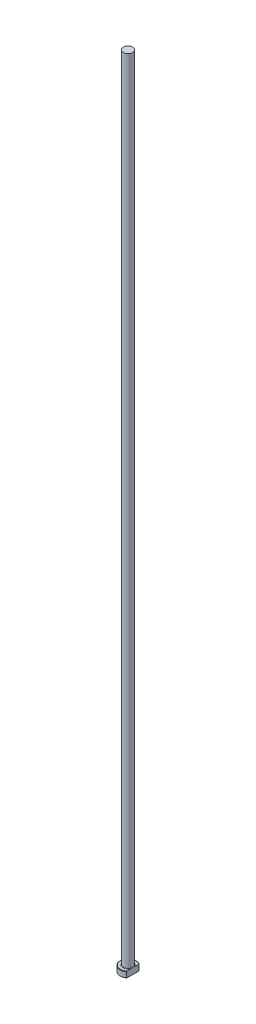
from build123d import *
from build123d.topology import SkipClean

# Parameters (mm, degrees)
CHAMFER1_SIZE = 0.2
FILLET1_R     = 0.2
KEY_DEPTH     = 401.039998


with BuildPart() as part:
    # Sketch1 → Revolve1 (revolve)
    with BuildSketch(Plane.XY, mode=Mode.PRIVATE) as revolve1_sk:
        Polygon((0, 0), (-4, 0), (-4, 3), (-2.35, 3), (-2.35, 400), (0, 400), align=None)
    revolve(revolve1_sk.sketch.rotate(Axis((0, 259.958771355, 0), (0, -1, 0)), 270), axis=Axis((0, 259.958771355, 0), (0, -1, 0)))

    # Chamfer1
    chamfer1_edges = [part.edges().sort_by_distance(p)[0] for p in [
        (0, 3, -4),
        (0, 0, -4),
    ]]
    chamfer(chamfer1_edges, length=CHAMFER1_SIZE)

    # Fillet1
    fillet1_edges = [part.edges().sort_by_distance(p)[0] for p in [
        (0, 3, -2.35),
    ]]
    fillet(fillet1_edges, radius=FILLET1_R)

    # Sketch2 → KEY (cut, through all)
    with SkipClean():  # the faces are left unmerged after this step: merging them gives an invalid solid
        with BuildSketch(Plane(origin=(0, 0, 0), x_dir=(1, 0, 0), z_dir=(0, 1, 0))):
            with BuildLine():
                Line((2.35, 3.236896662), (2.35, -3.236896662))
                ThreePointArc((2.35, -3.236896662), (4, 0), (2.35, 3.236896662))
            make_face()
        extrude(amount=KEY_DEPTH, mode=Mode.SUBTRACT)


solid = part.part
